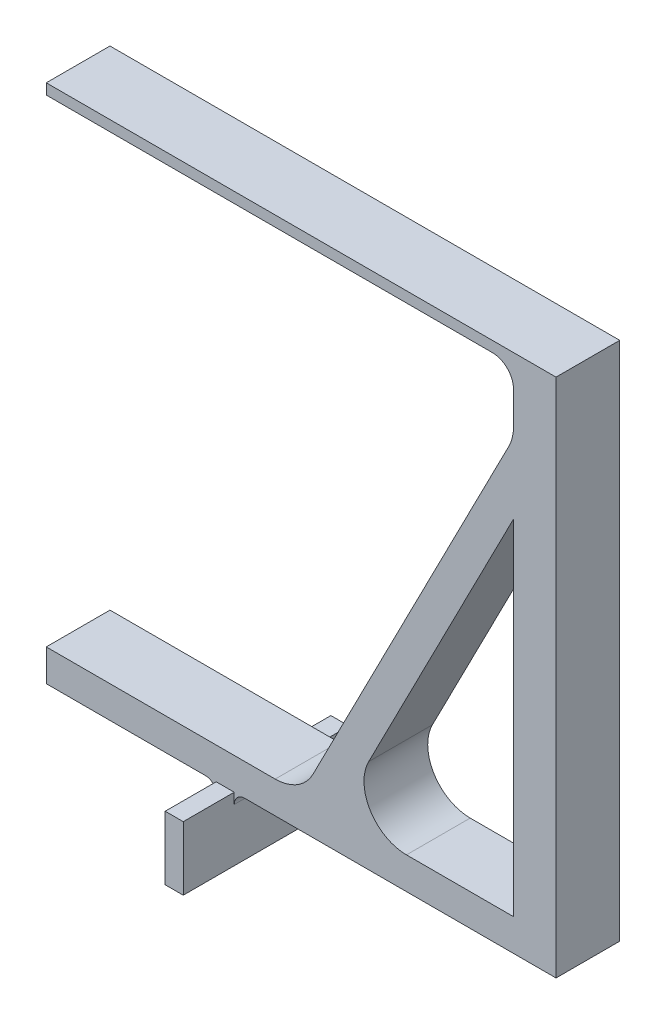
ISO-10303-21;
HEADER;
FILE_DESCRIPTION(('STEP AP214'),'2;1');
FILE_NAME('part.step','',(''),(''),'','','');
FILE_SCHEMA(('AUTOMOTIVE_DESIGN { 1 0 10303 214 1 1 1 1 }'));
ENDSEC;
DATA;
#1=APPLICATION_CONTEXT('core data for automotive mechanical design processes');
#2=APPLICATION_PROTOCOL_DEFINITION('international standard','automotive_design',2000,#1);
#3=PRODUCT_CONTEXT('',#1,'mechanical');
#4=PRODUCT('Part','Part','',(#3));
#5=PRODUCT_RELATED_PRODUCT_CATEGORY('part','',(#4));
#6=PRODUCT_DEFINITION_FORMATION('','',#4);
#7=PRODUCT_DEFINITION_CONTEXT('part definition',#1,'design');
#8=PRODUCT_DEFINITION('design','',#6,#7);
#9=PRODUCT_DEFINITION_SHAPE('','',#8);
#10=(LENGTH_UNIT() NAMED_UNIT(*) SI_UNIT(.MILLI.,.METRE.));
#11=(NAMED_UNIT(*) PLANE_ANGLE_UNIT() SI_UNIT($,.RADIAN.));
#12=(NAMED_UNIT(*) SI_UNIT($,.STERADIAN.) SOLID_ANGLE_UNIT());
#13=UNCERTAINTY_MEASURE_WITH_UNIT(LENGTH_MEASURE(1.E-05),#10,'distance_accuracy_value','');
#14=(GEOMETRIC_REPRESENTATION_CONTEXT(3) GLOBAL_UNCERTAINTY_ASSIGNED_CONTEXT((#13)) GLOBAL_UNIT_ASSIGNED_CONTEXT((#10,
#11,#12)) REPRESENTATION_CONTEXT('',''));
#15=CARTESIAN_POINT('',(0.,0.,0.));
#16=DIRECTION('',(0.,0.,1.));
#17=DIRECTION('',(1.,0.,0.));
#18=AXIS2_PLACEMENT_3D('',#15,#16,#17);
#19=CARTESIAN_POINT('',(0.,0.,3.));
#20=DIRECTION('',(0.,0.,1.));
#21=DIRECTION('',(1.,0.,0.));
#22=AXIS2_PLACEMENT_3D('',#19,#20,#21);
#23=PLANE('',#22);
#24=DIRECTION('',(-1.,0.,0.));
#25=VECTOR('',#24,1.);
#26=CARTESIAN_POINT('',(0.,3.,3.));
#27=LINE('',#26,#25);
#28=CARTESIAN_POINT('',(0.85,3.,3.));
#29=VERTEX_POINT('',#28);
#30=CARTESIAN_POINT('',(0.,3.,3.));
#31=VERTEX_POINT('',#30);
#32=EDGE_CURVE('E276',#29,#31,#27,.T.);
#33=ORIENTED_EDGE('',*,*,#32,.F.);
#34=DIRECTION('',(0.,1.,0.));
#35=VECTOR('',#34,1.);
#36=CARTESIAN_POINT('',(0.85,3.,3.));
#37=LINE('',#36,#35);
#38=CARTESIAN_POINT('',(0.85,2.5,3.));
#39=VERTEX_POINT('',#38);
#40=EDGE_CURVE('E401',#39,#29,#37,.T.);
#41=ORIENTED_EDGE('',*,*,#40,.F.);
#42=CARTESIAN_POINT('',(1.35,2.5,3.));
#43=DIRECTION('',(0.,0.,1.));
#44=DIRECTION('',(1.,0.,0.));
#45=AXIS2_PLACEMENT_3D('',#42,#43,#44);
#46=CIRCLE('',#45,0.5);
#47=CARTESIAN_POINT('',(1.35,3.,3.));
#48=VERTEX_POINT('',#47);
#49=EDGE_CURVE('E11',#39,#48,#46,.F.);
#50=ORIENTED_EDGE('',*,*,#49,.T.);
#51=DIRECTION('',(1.,0.,0.));
#52=VECTOR('',#51,1.);
#53=CARTESIAN_POINT('',(0.85,3.,3.));
#54=LINE('',#53,#52);
#55=CARTESIAN_POINT('',(16.,3.,3.));
#56=VERTEX_POINT('',#55);
#57=EDGE_CURVE('E222',#48,#56,#54,.T.);
#58=ORIENTED_EDGE('',*,*,#57,.T.);
#59=DIRECTION('',(0.,1.,0.));
#60=VECTOR('',#59,1.);
#61=CARTESIAN_POINT('',(16.,3.,3.));
#62=LINE('',#61,#60);
#63=CARTESIAN_POINT('',(16.,27.5,3.));
#64=VERTEX_POINT('',#63);
#65=EDGE_CURVE('E302',#56,#64,#62,.T.);
#66=ORIENTED_EDGE('',*,*,#65,.T.);
#67=DIRECTION('',(-1.,0.,0.));
#68=VECTOR('',#67,1.);
#69=CARTESIAN_POINT('',(14.,27.5,3.));
#70=LINE('',#69,#68);
#71=CARTESIAN_POINT('',(-8.,27.5,3.));
#72=VERTEX_POINT('',#71);
#73=EDGE_CURVE('E304',#64,#72,#70,.T.);
#74=ORIENTED_EDGE('',*,*,#73,.T.);
#75=DIRECTION('',(0.,-1.,0.));
#76=VECTOR('',#75,1.);
#77=CARTESIAN_POINT('',(-8.,27.5,3.));
#78=LINE('',#77,#76);
#79=CARTESIAN_POINT('',(-8.,27.,3.));
#80=VERTEX_POINT('',#79);
#81=EDGE_CURVE('E306',#72,#80,#78,.T.);
#82=ORIENTED_EDGE('',*,*,#81,.T.);
#83=DIRECTION('',(1.,0.,0.));
#84=VECTOR('',#83,1.);
#85=CARTESIAN_POINT('',(14.,27.,3.));
#86=LINE('',#85,#84);
#87=CARTESIAN_POINT('',(13.,27.,3.));
#88=VERTEX_POINT('',#87);
#89=EDGE_CURVE('E308',#80,#88,#86,.T.);
#90=ORIENTED_EDGE('',*,*,#89,.T.);
#91=CARTESIAN_POINT('',(13.,26.,3.));
#92=DIRECTION('',(0.,0.,1.));
#93=DIRECTION('',(1.,0.,0.));
#94=AXIS2_PLACEMENT_3D('',#91,#92,#93);
#95=CIRCLE('',#94,1.);
#96=CARTESIAN_POINT('',(14.,26.,3.));
#97=VERTEX_POINT('',#96);
#98=EDGE_CURVE('E388',#88,#97,#95,.F.);
#99=ORIENTED_EDGE('',*,*,#98,.T.);
#100=DIRECTION('',(0.,-1.,0.));
#101=VECTOR('',#100,1.);
#102=CARTESIAN_POINT('',(14.,24.,3.));
#103=LINE('',#102,#101);
#104=CARTESIAN_POINT('',(14.,24.4829214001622,3.));
#105=VERTEX_POINT('',#104);
#106=EDGE_CURVE('E311',#97,#105,#103,.T.);
#107=ORIENTED_EDGE('',*,*,#106,.T.);
#108=CARTESIAN_POINT('',(12.,24.4829214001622,3.));
#109=DIRECTION('',(0.,0.,1.));
#110=DIRECTION('',(1.,0.,0.));
#111=AXIS2_PLACEMENT_3D('',#108,#109,#110);
#112=CIRCLE('',#111,2.);
#113=CARTESIAN_POINT('',(13.7796349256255,23.5702881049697,3.));
#114=VERTEX_POINT('',#113);
#115=EDGE_CURVE('E375',#105,#114,#112,.F.);
#116=ORIENTED_EDGE('',*,*,#115,.T.);
#117=DIRECTION('',(-0.456316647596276,-0.889817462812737,0.));
#118=VECTOR('',#117,1.);
#119=CARTESIAN_POINT('',(14.,24.,3.));
#120=LINE('',#119,#118);
#121=CARTESIAN_POINT('',(4.5576239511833,5.58736670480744,3.));
#122=VERTEX_POINT('',#121);
#123=EDGE_CURVE('E313',#114,#122,#120,.T.);
#124=ORIENTED_EDGE('',*,*,#123,.T.);
#125=CARTESIAN_POINT('',(2.77798902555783,6.5,3.));
#126=DIRECTION('',(0.,0.,1.));
#127=DIRECTION('',(1.,0.,0.));
#128=AXIS2_PLACEMENT_3D('',#125,#126,#127);
#129=CIRCLE('',#128,2.);
#130=CARTESIAN_POINT('',(2.77798902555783,4.5,3.));
#131=VERTEX_POINT('',#130);
#132=EDGE_CURVE('E379',#122,#131,#129,.F.);
#133=ORIENTED_EDGE('',*,*,#132,.T.);
#134=DIRECTION('',(-1.,0.,0.));
#135=VECTOR('',#134,1.);
#136=CARTESIAN_POINT('',(-4.,4.5,3.));
#137=LINE('',#136,#135);
#138=CARTESIAN_POINT('',(-8.,4.5,3.));
#139=VERTEX_POINT('',#138);
#140=EDGE_CURVE('E316',#131,#139,#137,.T.);
#141=ORIENTED_EDGE('',*,*,#140,.T.);
#142=DIRECTION('',(0.,1.,0.));
#143=VECTOR('',#142,1.);
#144=CARTESIAN_POINT('',(-8.,3.,3.));
#145=LINE('',#144,#143);
#146=CARTESIAN_POINT('',(-8.,3.,3.));
#147=VERTEX_POINT('',#146);
#148=EDGE_CURVE('E233',#147,#139,#145,.T.);
#149=ORIENTED_EDGE('',*,*,#148,.F.);
#150=DIRECTION('',(1.,0.,0.));
#151=VECTOR('',#150,1.);
#152=CARTESIAN_POINT('',(0.,3.,3.));
#153=LINE('',#152,#151);
#154=CARTESIAN_POINT('',(-0.5,3.,3.));
#155=VERTEX_POINT('',#154);
#156=EDGE_CURVE('E229',#147,#155,#153,.T.);
#157=ORIENTED_EDGE('',*,*,#156,.T.);
#158=CARTESIAN_POINT('',(-0.5,2.5,3.));
#159=DIRECTION('',(0.,0.,1.));
#160=DIRECTION('',(1.,0.,0.));
#161=AXIS2_PLACEMENT_3D('',#158,#159,#160);
#162=CIRCLE('',#161,0.5);
#163=CARTESIAN_POINT('',(0.,2.5,3.));
#164=VERTEX_POINT('',#163);
#165=EDGE_CURVE('E408',#155,#164,#162,.F.);
#166=ORIENTED_EDGE('',*,*,#165,.T.);
#167=DIRECTION('',(0.,-1.,0.));
#168=VECTOR('',#167,1.);
#169=CARTESIAN_POINT('',(0.,3.,3.));
#170=LINE('',#169,#168);
#171=EDGE_CURVE('E60',#31,#164,#170,.T.);
#172=ORIENTED_EDGE('',*,*,#171,.F.);
#173=EDGE_LOOP('',(#33,#41,#50,#58,#66,#74,#82,#90,#99,#107,#116,#124,#133,#141,#149,#157,#166,#172));
#174=FACE_BOUND('',#173,.T.);
#175=DIRECTION('',(0.,1.,0.));
#176=VECTOR('',#175,1.);
#177=CARTESIAN_POINT('',(14.,4.5,3.));
#178=LINE('',#177,#176);
#179=CARTESIAN_POINT('',(14.,4.5,3.));
#180=VERTEX_POINT('',#179);
#181=CARTESIAN_POINT('',(14.,20.7128089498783,3.));
#182=VERTEX_POINT('',#181);
#183=EDGE_CURVE('E282',#180,#182,#178,.T.);
#184=ORIENTED_EDGE('',*,*,#183,.F.);
#185=DIRECTION('',(1.,0.,0.));
#186=VECTOR('',#185,1.);
#187=CARTESIAN_POINT('',(5.6857390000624,4.5,3.));
#188=LINE('',#187,#186);
#189=CARTESIAN_POINT('',(8.95903202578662,4.5,3.));
#190=VERTEX_POINT('',#189);
#191=EDGE_CURVE('E280',#190,#180,#188,.T.);
#192=ORIENTED_EDGE('',*,*,#191,.F.);
#193=CARTESIAN_POINT('',(8.95903202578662,6.5,3.));
#194=DIRECTION('',(0.,0.,1.));
#195=DIRECTION('',(1.,0.,0.));
#196=AXIS2_PLACEMENT_3D('',#193,#194,#195);
#197=CIRCLE('',#196,2.);
#198=CARTESIAN_POINT('',(7.17939710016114,7.41263329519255,3.));
#199=VERTEX_POINT('',#198);
#200=EDGE_CURVE('E370',#190,#199,#197,.F.);
#201=ORIENTED_EDGE('',*,*,#200,.T.);
#202=DIRECTION('',(-0.456316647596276,-0.889817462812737,0.));
#203=VECTOR('',#202,1.);
#204=CARTESIAN_POINT('',(5.6857390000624,4.5,3.));
#205=LINE('',#204,#203);
#206=EDGE_CURVE('E286',#182,#199,#205,.T.);
#207=ORIENTED_EDGE('',*,*,#206,.F.);
#208=EDGE_LOOP('',(#184,#192,#201,#207));
#209=FACE_BOUND('',#208,.T.);
#210=ADVANCED_FACE('F37',(#174,#209),#23,.T.);
#211=CARTESIAN_POINT('',(0.,0.,0.));
#212=DIRECTION('',(0.,0.,1.));
#213=DIRECTION('',(1.,0.,0.));
#214=AXIS2_PLACEMENT_3D('',#211,#212,#213);
#215=PLANE('',#214);
#216=DIRECTION('',(1.,0.,0.));
#217=VECTOR('',#216,1.);
#218=CARTESIAN_POINT('',(0.85,3.,0.));
#219=LINE('',#218,#217);
#220=CARTESIAN_POINT('',(1.35,3.,0.));
#221=VERTEX_POINT('',#220);
#222=CARTESIAN_POINT('',(16.,3.,0.));
#223=VERTEX_POINT('',#222);
#224=EDGE_CURVE('E300',#221,#223,#219,.T.);
#225=ORIENTED_EDGE('',*,*,#224,.F.);
#226=CARTESIAN_POINT('',(1.35,2.5,0.));
#227=DIRECTION('',(0.,0.,1.));
#228=DIRECTION('',(1.,0.,0.));
#229=AXIS2_PLACEMENT_3D('',#226,#227,#228);
#230=CIRCLE('',#229,0.5);
#231=CARTESIAN_POINT('',(0.85,2.5,0.));
#232=VERTEX_POINT('',#231);
#233=EDGE_CURVE('E45',#221,#232,#230,.T.);
#234=ORIENTED_EDGE('',*,*,#233,.T.);
#235=DIRECTION('',(0.,-1.,0.));
#236=VECTOR('',#235,1.);
#237=CARTESIAN_POINT('',(0.85,0.,0.));
#238=LINE('',#237,#236);
#239=CARTESIAN_POINT('',(0.85,3.,0.));
#240=VERTEX_POINT('',#239);
#241=EDGE_CURVE('E52',#240,#232,#238,.T.);
#242=ORIENTED_EDGE('',*,*,#241,.F.);
#243=DIRECTION('',(-1.,0.,0.));
#244=VECTOR('',#243,1.);
#245=CARTESIAN_POINT('',(0.,3.,0.));
#246=LINE('',#245,#244);
#247=CARTESIAN_POINT('',(0.,3.,0.));
#248=VERTEX_POINT('',#247);
#249=EDGE_CURVE('E271',#240,#248,#246,.T.);
#250=ORIENTED_EDGE('',*,*,#249,.T.);
#251=DIRECTION('',(0.,1.,0.));
#252=VECTOR('',#251,1.);
#253=CARTESIAN_POINT('',(0.,0.,0.));
#254=LINE('',#253,#252);
#255=CARTESIAN_POINT('',(0.,2.5,0.));
#256=VERTEX_POINT('',#255);
#257=EDGE_CURVE('E394',#256,#248,#254,.T.);
#258=ORIENTED_EDGE('',*,*,#257,.F.);
#259=CARTESIAN_POINT('',(-0.5,2.5,0.));
#260=DIRECTION('',(0.,0.,1.));
#261=DIRECTION('',(1.,0.,0.));
#262=AXIS2_PLACEMENT_3D('',#259,#260,#261);
#263=CIRCLE('',#262,0.5);
#264=CARTESIAN_POINT('',(-0.5,3.,0.));
#265=VERTEX_POINT('',#264);
#266=EDGE_CURVE('E219',#256,#265,#263,.T.);
#267=ORIENTED_EDGE('',*,*,#266,.T.);
#268=DIRECTION('',(1.,0.,0.));
#269=VECTOR('',#268,1.);
#270=CARTESIAN_POINT('',(0.,3.,0.));
#271=LINE('',#270,#269);
#272=CARTESIAN_POINT('',(-8.,3.,0.));
#273=VERTEX_POINT('',#272);
#274=EDGE_CURVE('E210',#273,#265,#271,.T.);
#275=ORIENTED_EDGE('',*,*,#274,.F.);
#276=DIRECTION('',(0.,-1.,0.));
#277=VECTOR('',#276,1.);
#278=CARTESIAN_POINT('',(-8.,3.,0.));
#279=LINE('',#278,#277);
#280=CARTESIAN_POINT('',(-8.,4.5,0.));
#281=VERTEX_POINT('',#280);
#282=EDGE_CURVE('E217',#281,#273,#279,.T.);
#283=ORIENTED_EDGE('',*,*,#282,.F.);
#284=DIRECTION('',(-1.,0.,0.));
#285=VECTOR('',#284,1.);
#286=CARTESIAN_POINT('',(-4.,4.5,0.));
#287=LINE('',#286,#285);
#288=CARTESIAN_POINT('',(2.77798902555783,4.5,0.));
#289=VERTEX_POINT('',#288);
#290=EDGE_CURVE('E223',#289,#281,#287,.T.);
#291=ORIENTED_EDGE('',*,*,#290,.F.);
#292=CARTESIAN_POINT('',(2.77798902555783,6.5,0.));
#293=DIRECTION('',(0.,0.,1.));
#294=DIRECTION('',(1.,0.,0.));
#295=AXIS2_PLACEMENT_3D('',#292,#293,#294);
#296=CIRCLE('',#295,2.);
#297=CARTESIAN_POINT('',(4.5576239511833,5.58736670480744,0.));
#298=VERTEX_POINT('',#297);
#299=EDGE_CURVE('E377',#289,#298,#296,.T.);
#300=ORIENTED_EDGE('',*,*,#299,.T.);
#301=DIRECTION('',(-0.456316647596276,-0.889817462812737,0.));
#302=VECTOR('',#301,1.);
#303=CARTESIAN_POINT('',(14.,24.,0.));
#304=LINE('',#303,#302);
#305=CARTESIAN_POINT('',(13.7796349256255,23.5702881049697,0.));
#306=VERTEX_POINT('',#305);
#307=EDGE_CURVE('E333',#306,#298,#304,.T.);
#308=ORIENTED_EDGE('',*,*,#307,.F.);
#309=CARTESIAN_POINT('',(12.,24.4829214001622,0.));
#310=DIRECTION('',(0.,0.,1.));
#311=DIRECTION('',(1.,0.,0.));
#312=AXIS2_PLACEMENT_3D('',#309,#310,#311);
#313=CIRCLE('',#312,2.);
#314=CARTESIAN_POINT('',(14.,24.4829214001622,0.));
#315=VERTEX_POINT('',#314);
#316=EDGE_CURVE('E372',#306,#315,#313,.T.);
#317=ORIENTED_EDGE('',*,*,#316,.T.);
#318=DIRECTION('',(0.,-1.,0.));
#319=VECTOR('',#318,1.);
#320=CARTESIAN_POINT('',(14.,24.,0.));
#321=LINE('',#320,#319);
#322=CARTESIAN_POINT('',(14.,26.,0.));
#323=VERTEX_POINT('',#322);
#324=EDGE_CURVE('E331',#323,#315,#321,.T.);
#325=ORIENTED_EDGE('',*,*,#324,.F.);
#326=CARTESIAN_POINT('',(13.,26.,0.));
#327=DIRECTION('',(0.,0.,1.));
#328=DIRECTION('',(1.,0.,0.));
#329=AXIS2_PLACEMENT_3D('',#326,#327,#328);
#330=CIRCLE('',#329,1.);
#331=CARTESIAN_POINT('',(13.,27.,0.));
#332=VERTEX_POINT('',#331);
#333=EDGE_CURVE('E386',#323,#332,#330,.T.);
#334=ORIENTED_EDGE('',*,*,#333,.T.);
#335=DIRECTION('',(1.,0.,0.));
#336=VECTOR('',#335,1.);
#337=CARTESIAN_POINT('',(14.,27.,0.));
#338=LINE('',#337,#336);
#339=CARTESIAN_POINT('',(-8.,27.,0.));
#340=VERTEX_POINT('',#339);
#341=EDGE_CURVE('E328',#340,#332,#338,.T.);
#342=ORIENTED_EDGE('',*,*,#341,.F.);
#343=DIRECTION('',(0.,-1.,0.));
#344=VECTOR('',#343,1.);
#345=CARTESIAN_POINT('',(-8.,27.5,0.));
#346=LINE('',#345,#344);
#347=CARTESIAN_POINT('',(-8.,27.5,0.));
#348=VERTEX_POINT('',#347);
#349=EDGE_CURVE('E326',#348,#340,#346,.T.);
#350=ORIENTED_EDGE('',*,*,#349,.F.);
#351=DIRECTION('',(-1.,0.,0.));
#352=VECTOR('',#351,1.);
#353=CARTESIAN_POINT('',(14.,27.5,0.));
#354=LINE('',#353,#352);
#355=CARTESIAN_POINT('',(16.,27.5,0.));
#356=VERTEX_POINT('',#355);
#357=EDGE_CURVE('E324',#356,#348,#354,.T.);
#358=ORIENTED_EDGE('',*,*,#357,.F.);
#359=DIRECTION('',(0.,1.,0.));
#360=VECTOR('',#359,1.);
#361=CARTESIAN_POINT('',(16.,3.,0.));
#362=LINE('',#361,#360);
#363=EDGE_CURVE('E321',#223,#356,#362,.T.);
#364=ORIENTED_EDGE('',*,*,#363,.F.);
#365=EDGE_LOOP('',(#225,#234,#242,#250,#258,#267,#275,#283,#291,#300,#308,#317,#325,#334,#342,
#350,#358,#364));
#366=FACE_BOUND('',#365,.T.);
#367=DIRECTION('',(-0.456316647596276,-0.889817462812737,0.));
#368=VECTOR('',#367,1.);
#369=CARTESIAN_POINT('',(5.6857390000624,4.5,0.));
#370=LINE('',#369,#368);
#371=CARTESIAN_POINT('',(14.,20.7128089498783,0.));
#372=VERTEX_POINT('',#371);
#373=CARTESIAN_POINT('',(7.17939710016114,7.41263329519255,0.));
#374=VERTEX_POINT('',#373);
#375=EDGE_CURVE('E283',#372,#374,#370,.T.);
#376=ORIENTED_EDGE('',*,*,#375,.T.);
#377=CARTESIAN_POINT('',(8.95903202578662,6.5,0.));
#378=DIRECTION('',(0.,0.,1.));
#379=DIRECTION('',(1.,0.,0.));
#380=AXIS2_PLACEMENT_3D('',#377,#378,#379);
#381=CIRCLE('',#380,2.);
#382=CARTESIAN_POINT('',(8.95903202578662,4.5,0.));
#383=VERTEX_POINT('',#382);
#384=EDGE_CURVE('E368',#374,#383,#381,.T.);
#385=ORIENTED_EDGE('',*,*,#384,.T.);
#386=DIRECTION('',(1.,0.,0.));
#387=VECTOR('',#386,1.);
#388=CARTESIAN_POINT('',(5.6857390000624,4.5,0.));
#389=LINE('',#388,#387);
#390=CARTESIAN_POINT('',(14.,4.5,0.));
#391=VERTEX_POINT('',#390);
#392=EDGE_CURVE('E279',#383,#391,#389,.T.);
#393=ORIENTED_EDGE('',*,*,#392,.T.);
#394=DIRECTION('',(0.,1.,0.));
#395=VECTOR('',#394,1.);
#396=CARTESIAN_POINT('',(14.,4.5,0.));
#397=LINE('',#396,#395);
#398=EDGE_CURVE('E291',#391,#372,#397,.T.);
#399=ORIENTED_EDGE('',*,*,#398,.T.);
#400=EDGE_LOOP('',(#376,#385,#393,#399));
#401=FACE_BOUND('',#400,.T.);
#402=ADVANCED_FACE('F213',(#366,#401),#215,.F.);
#403=CARTESIAN_POINT('',(0.85,3.,3.));
#404=DIRECTION('',(-1.,0.,0.));
#405=DIRECTION('',(0.,-1.,0.));
#406=AXIS2_PLACEMENT_3D('',#403,#404,#405);
#407=PLANE('',#406);
#408=DIRECTION('',(0.,0.,1.));
#409=VECTOR('',#408,1.);
#410=CARTESIAN_POINT('',(0.85,3.,-2.4));
#411=LINE('',#410,#409);
#412=CARTESIAN_POINT('',(0.85,3.,-2.4));
#413=VERTEX_POINT('',#412);
#414=EDGE_CURVE('E273',#413,#240,#411,.T.);
#415=ORIENTED_EDGE('',*,*,#414,.T.);
#416=ORIENTED_EDGE('',*,*,#241,.T.);
#417=DIRECTION('',(0.,0.,-1.));
#418=VECTOR('',#417,1.);
#419=CARTESIAN_POINT('',(0.85,2.5,3.));
#420=LINE('',#419,#418);
#421=EDGE_CURVE('E403',#232,#39,#420,.F.);
#422=ORIENTED_EDGE('',*,*,#421,.T.);
#423=ORIENTED_EDGE('',*,*,#40,.T.);
#424=CARTESIAN_POINT('',(0.85,3.,5.4));
#425=VERTEX_POINT('',#424);
#426=EDGE_CURVE('E267',#29,#425,#411,.T.);
#427=ORIENTED_EDGE('',*,*,#426,.T.);
#428=DIRECTION('',(0.,1.,0.));
#429=VECTOR('',#428,1.);
#430=CARTESIAN_POINT('',(0.85,0.,5.4));
#431=LINE('',#430,#429);
#432=CARTESIAN_POINT('',(0.85,0.,5.4));
#433=VERTEX_POINT('',#432);
#434=EDGE_CURVE('E249',#433,#425,#431,.T.);
#435=ORIENTED_EDGE('',*,*,#434,.F.);
#436=DIRECTION('',(0.,0.,-1.));
#437=VECTOR('',#436,1.);
#438=CARTESIAN_POINT('',(0.85,0.,3.));
#439=LINE('',#438,#437);
#440=CARTESIAN_POINT('',(0.85,0.,-2.4));
#441=VERTEX_POINT('',#440);
#442=EDGE_CURVE('E319',#433,#441,#439,.T.);
#443=ORIENTED_EDGE('',*,*,#442,.T.);
#444=DIRECTION('',(0.,1.,0.));
#445=VECTOR('',#444,1.);
#446=CARTESIAN_POINT('',(0.85,0.,-2.4));
#447=LINE('',#446,#445);
#448=EDGE_CURVE('E261',#441,#413,#447,.T.);
#449=ORIENTED_EDGE('',*,*,#448,.T.);
#450=EDGE_LOOP('',(#415,#416,#422,#423,#427,#435,#443,#449));
#451=FACE_BOUND('',#450,.T.);
#452=ADVANCED_FACE('F414',(#451),#407,.F.);
#453=CARTESIAN_POINT('',(0.85,3.,3.));
#454=DIRECTION('',(0.,1.,0.));
#455=DIRECTION('',(0.,0.,1.));
#456=AXIS2_PLACEMENT_3D('',#453,#454,#455);
#457=PLANE('',#456);
#458=ORIENTED_EDGE('',*,*,#57,.F.);
#459=DIRECTION('',(0.,0.,-1.));
#460=VECTOR('',#459,1.);
#461=CARTESIAN_POINT('',(1.35,3.,0.));
#462=LINE('',#461,#460);
#463=EDGE_CURVE('E398',#48,#221,#462,.T.);
#464=ORIENTED_EDGE('',*,*,#463,.T.);
#465=ORIENTED_EDGE('',*,*,#224,.T.);
#466=DIRECTION('',(0.,0.,-1.));
#467=VECTOR('',#466,1.);
#468=CARTESIAN_POINT('',(16.,3.,3.));
#469=LINE('',#468,#467);
#470=EDGE_CURVE('E349',#56,#223,#469,.T.);
#471=ORIENTED_EDGE('',*,*,#470,.F.);
#472=EDGE_LOOP('',(#458,#464,#465,#471));
#473=FACE_BOUND('',#472,.T.);
#474=ADVANCED_FACE('F421',(#473),#457,.F.);
#475=CARTESIAN_POINT('',(16.,3.,3.));
#476=DIRECTION('',(-1.,0.,0.));
#477=DIRECTION('',(0.,-1.,0.));
#478=AXIS2_PLACEMENT_3D('',#475,#476,#477);
#479=PLANE('',#478);
#480=ORIENTED_EDGE('',*,*,#363,.T.);
#481=DIRECTION('',(0.,0.,-1.));
#482=VECTOR('',#481,1.);
#483=CARTESIAN_POINT('',(16.,27.5,3.));
#484=LINE('',#483,#482);
#485=EDGE_CURVE('E346',#64,#356,#484,.T.);
#486=ORIENTED_EDGE('',*,*,#485,.F.);
#487=ORIENTED_EDGE('',*,*,#65,.F.);
#488=ORIENTED_EDGE('',*,*,#470,.T.);
#489=EDGE_LOOP('',(#480,#486,#487,#488));
#490=FACE_BOUND('',#489,.T.);
#491=ADVANCED_FACE('F425',(#490),#479,.F.);
#492=CARTESIAN_POINT('',(14.,27.5,3.));
#493=DIRECTION('',(0.,-1.,0.));
#494=DIRECTION('',(1.,0.,0.));
#495=AXIS2_PLACEMENT_3D('',#492,#493,#494);
#496=PLANE('',#495);
#497=ORIENTED_EDGE('',*,*,#357,.T.);
#498=DIRECTION('',(0.,0.,-1.));
#499=VECTOR('',#498,1.);
#500=CARTESIAN_POINT('',(-8.,27.5,3.));
#501=LINE('',#500,#499);
#502=EDGE_CURVE('E343',#72,#348,#501,.T.);
#503=ORIENTED_EDGE('',*,*,#502,.F.);
#504=ORIENTED_EDGE('',*,*,#73,.F.);
#505=ORIENTED_EDGE('',*,*,#485,.T.);
#506=EDGE_LOOP('',(#497,#503,#504,#505));
#507=FACE_BOUND('',#506,.T.);
#508=ADVANCED_FACE('F431',(#507),#496,.F.);
#509=CARTESIAN_POINT('',(-8.,27.5,3.));
#510=DIRECTION('',(1.,0.,0.));
#511=DIRECTION('',(0.,0.,-1.));
#512=AXIS2_PLACEMENT_3D('',#509,#510,#511);
#513=PLANE('',#512);
#514=ORIENTED_EDGE('',*,*,#349,.T.);
#515=DIRECTION('',(0.,0.,-1.));
#516=VECTOR('',#515,1.);
#517=CARTESIAN_POINT('',(-8.,27.,3.));
#518=LINE('',#517,#516);
#519=EDGE_CURVE('E340',#80,#340,#518,.T.);
#520=ORIENTED_EDGE('',*,*,#519,.F.);
#521=ORIENTED_EDGE('',*,*,#81,.F.);
#522=ORIENTED_EDGE('',*,*,#502,.T.);
#523=EDGE_LOOP('',(#514,#520,#521,#522));
#524=FACE_BOUND('',#523,.T.);
#525=ADVANCED_FACE('F434',(#524),#513,.F.);
#526=CARTESIAN_POINT('',(14.,27.,3.));
#527=DIRECTION('',(0.,1.,0.));
#528=DIRECTION('',(-1.,0.,0.));
#529=AXIS2_PLACEMENT_3D('',#526,#527,#528);
#530=PLANE('',#529);
#531=ORIENTED_EDGE('',*,*,#341,.T.);
#532=DIRECTION('',(0.,0.,-1.));
#533=VECTOR('',#532,1.);
#534=CARTESIAN_POINT('',(13.,27.,3.));
#535=LINE('',#534,#533);
#536=EDGE_CURVE('E384',#332,#88,#535,.F.);
#537=ORIENTED_EDGE('',*,*,#536,.T.);
#538=ORIENTED_EDGE('',*,*,#89,.F.);
#539=ORIENTED_EDGE('',*,*,#519,.T.);
#540=EDGE_LOOP('',(#531,#537,#538,#539));
#541=FACE_BOUND('',#540,.T.);
#542=ADVANCED_FACE('F438',(#541),#530,.F.);
#543=CARTESIAN_POINT('',(14.,24.,3.));
#544=DIRECTION('',(1.,0.,0.));
#545=DIRECTION('',(0.,1.,0.));
#546=AXIS2_PLACEMENT_3D('',#543,#544,#545);
#547=PLANE('',#546);
#548=ORIENTED_EDGE('',*,*,#106,.F.);
#549=DIRECTION('',(0.,0.,-1.));
#550=VECTOR('',#549,1.);
#551=CARTESIAN_POINT('',(14.,26.,0.));
#552=LINE('',#551,#550);
#553=EDGE_CURVE('E381',#97,#323,#552,.T.);
#554=ORIENTED_EDGE('',*,*,#553,.T.);
#555=ORIENTED_EDGE('',*,*,#324,.T.);
#556=DIRECTION('',(0.,0.,-1.));
#557=VECTOR('',#556,1.);
#558=CARTESIAN_POINT('',(14.,24.4829214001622,3.));
#559=LINE('',#558,#557);
#560=EDGE_CURVE('E362',#315,#105,#559,.F.);
#561=ORIENTED_EDGE('',*,*,#560,.T.);
#562=EDGE_LOOP('',(#548,#554,#555,#561));
#563=FACE_BOUND('',#562,.T.);
#564=ADVANCED_FACE('F447',(#563),#547,.F.);
#565=CARTESIAN_POINT('',(14.,24.,3.));
#566=DIRECTION('',(0.889817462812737,-0.456316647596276,0.));
#567=DIRECTION('',(0.456316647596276,0.889817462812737,0.));
#568=AXIS2_PLACEMENT_3D('',#565,#566,#567);
#569=PLANE('',#568);
#570=ORIENTED_EDGE('',*,*,#123,.F.);
#571=DIRECTION('',(0.,0.,-1.));
#572=VECTOR('',#571,1.);
#573=CARTESIAN_POINT('',(13.7796349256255,23.5702881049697,0.));
#574=LINE('',#573,#572);
#575=EDGE_CURVE('E359',#114,#306,#574,.T.);
#576=ORIENTED_EDGE('',*,*,#575,.T.);
#577=ORIENTED_EDGE('',*,*,#307,.T.);
#578=DIRECTION('',(0.,0.,-1.));
#579=VECTOR('',#578,1.);
#580=CARTESIAN_POINT('',(4.5576239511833,5.58736670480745,3.));
#581=LINE('',#580,#579);
#582=EDGE_CURVE('E357',#298,#122,#581,.F.);
#583=ORIENTED_EDGE('',*,*,#582,.T.);
#584=EDGE_LOOP('',(#570,#576,#577,#583));
#585=FACE_BOUND('',#584,.T.);
#586=ADVANCED_FACE('F457',(#585),#569,.F.);
#587=CARTESIAN_POINT('',(-4.,4.5,3.));
#588=DIRECTION('',(0.,-1.,0.));
#589=DIRECTION('',(0.,0.,-1.));
#590=AXIS2_PLACEMENT_3D('',#587,#588,#589);
#591=PLANE('',#590);
#592=ORIENTED_EDGE('',*,*,#140,.F.);
#593=DIRECTION('',(0.,0.,-1.));
#594=VECTOR('',#593,1.);
#595=CARTESIAN_POINT('',(2.77798902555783,4.5,0.));
#596=LINE('',#595,#594);
#597=EDGE_CURVE('E365',#131,#289,#596,.T.);
#598=ORIENTED_EDGE('',*,*,#597,.T.);
#599=ORIENTED_EDGE('',*,*,#290,.T.);
#600=DIRECTION('',(0.,0.,-1.));
#601=VECTOR('',#600,1.);
#602=CARTESIAN_POINT('',(-8.,4.5,0.));
#603=LINE('',#602,#601);
#604=EDGE_CURVE('E238',#139,#281,#603,.T.);
#605=ORIENTED_EDGE('',*,*,#604,.F.);
#606=EDGE_LOOP('',(#592,#598,#599,#605));
#607=FACE_BOUND('',#606,.T.);
#608=ADVANCED_FACE('F464',(#607),#591,.F.);
#609=CARTESIAN_POINT('',(0.,3.,3.));
#610=DIRECTION('',(0.,1.,0.));
#611=DIRECTION('',(-1.,0.,0.));
#612=AXIS2_PLACEMENT_3D('',#609,#610,#611);
#613=PLANE('',#612);
#614=ORIENTED_EDGE('',*,*,#274,.T.);
#615=DIRECTION('',(0.,0.,-1.));
#616=VECTOR('',#615,1.);
#617=CARTESIAN_POINT('',(-0.5,3.,3.));
#618=LINE('',#617,#616);
#619=EDGE_CURVE('E396',#265,#155,#618,.F.);
#620=ORIENTED_EDGE('',*,*,#619,.T.);
#621=ORIENTED_EDGE('',*,*,#156,.F.);
#622=DIRECTION('',(0.,0.,1.));
#623=VECTOR('',#622,1.);
#624=CARTESIAN_POINT('',(-8.,3.,0.));
#625=LINE('',#624,#623);
#626=EDGE_CURVE('E226',#273,#147,#625,.T.);
#627=ORIENTED_EDGE('',*,*,#626,.F.);
#628=EDGE_LOOP('',(#614,#620,#621,#627));
#629=FACE_BOUND('',#628,.T.);
#630=ADVANCED_FACE('F227',(#629),#613,.F.);
#631=CARTESIAN_POINT('',(0.,3.,3.));
#632=DIRECTION('',(1.,0.,0.));
#633=DIRECTION('',(0.,0.,-1.));
#634=AXIS2_PLACEMENT_3D('',#631,#632,#633);
#635=PLANE('',#634);
#636=DIRECTION('',(0.,0.,-1.));
#637=VECTOR('',#636,1.);
#638=CARTESIAN_POINT('',(0.,2.5,0.));
#639=LINE('',#638,#637);
#640=EDGE_CURVE('E391',#164,#256,#639,.T.);
#641=ORIENTED_EDGE('',*,*,#640,.T.);
#642=ORIENTED_EDGE('',*,*,#257,.T.);
#643=DIRECTION('',(0.,0.,1.));
#644=VECTOR('',#643,1.);
#645=CARTESIAN_POINT('',(0.,3.,-2.4));
#646=LINE('',#645,#644);
#647=CARTESIAN_POINT('',(0.,3.,-2.4));
#648=VERTEX_POINT('',#647);
#649=EDGE_CURVE('E268',#648,#248,#646,.T.);
#650=ORIENTED_EDGE('',*,*,#649,.F.);
#651=DIRECTION('',(0.,-1.,0.));
#652=VECTOR('',#651,1.);
#653=CARTESIAN_POINT('',(0.,0.,-2.4));
#654=LINE('',#653,#652);
#655=CARTESIAN_POINT('',(0.,0.,-2.4));
#656=VERTEX_POINT('',#655);
#657=EDGE_CURVE('E255',#648,#656,#654,.T.);
#658=ORIENTED_EDGE('',*,*,#657,.T.);
#659=DIRECTION('',(0.,0.,-1.));
#660=VECTOR('',#659,1.);
#661=CARTESIAN_POINT('',(0.,0.,3.));
#662=LINE('',#661,#660);
#663=CARTESIAN_POINT('',(0.,0.,5.4));
#664=VERTEX_POINT('',#663);
#665=EDGE_CURVE('E338',#664,#656,#662,.T.);
#666=ORIENTED_EDGE('',*,*,#665,.F.);
#667=DIRECTION('',(0.,-1.,0.));
#668=VECTOR('',#667,1.);
#669=CARTESIAN_POINT('',(0.,0.,5.4));
#670=LINE('',#669,#668);
#671=CARTESIAN_POINT('',(0.,3.,5.4));
#672=VERTEX_POINT('',#671);
#673=EDGE_CURVE('E243',#672,#664,#670,.T.);
#674=ORIENTED_EDGE('',*,*,#673,.F.);
#675=EDGE_CURVE('E272',#31,#672,#646,.T.);
#676=ORIENTED_EDGE('',*,*,#675,.F.);
#677=ORIENTED_EDGE('',*,*,#171,.T.);
#678=EDGE_LOOP('',(#641,#642,#650,#658,#666,#674,#676,#677));
#679=FACE_BOUND('',#678,.T.);
#680=ADVANCED_FACE('F471',(#679),#635,.F.);
#681=CARTESIAN_POINT('',(0.,0.,3.));
#682=DIRECTION('',(0.,1.,0.));
#683=DIRECTION('',(0.,0.,1.));
#684=AXIS2_PLACEMENT_3D('',#681,#682,#683);
#685=PLANE('',#684);
#686=ORIENTED_EDGE('',*,*,#665,.T.);
#687=DIRECTION('',(1.,0.,0.));
#688=VECTOR('',#687,1.);
#689=CARTESIAN_POINT('',(0.,0.,-2.4));
#690=LINE('',#689,#688);
#691=EDGE_CURVE('E258',#656,#441,#690,.T.);
#692=ORIENTED_EDGE('',*,*,#691,.T.);
#693=ORIENTED_EDGE('',*,*,#442,.F.);
#694=DIRECTION('',(1.,0.,0.));
#695=VECTOR('',#694,1.);
#696=CARTESIAN_POINT('',(0.,0.,5.4));
#697=LINE('',#696,#695);
#698=EDGE_CURVE('E246',#664,#433,#697,.T.);
#699=ORIENTED_EDGE('',*,*,#698,.F.);
#700=EDGE_LOOP('',(#686,#692,#693,#699));
#701=FACE_BOUND('',#700,.T.);
#702=ADVANCED_FACE('F484',(#701),#685,.F.);
#703=CARTESIAN_POINT('',(5.6857390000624,4.5,3.));
#704=DIRECTION('',(0.,1.,0.));
#705=DIRECTION('',(0.,0.,1.));
#706=AXIS2_PLACEMENT_3D('',#703,#704,#705);
#707=PLANE('',#706);
#708=ORIENTED_EDGE('',*,*,#392,.F.);
#709=DIRECTION('',(0.,0.,-1.));
#710=VECTOR('',#709,1.);
#711=CARTESIAN_POINT('',(8.95903202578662,4.5,3.));
#712=LINE('',#711,#710);
#713=EDGE_CURVE('E355',#383,#190,#712,.F.);
#714=ORIENTED_EDGE('',*,*,#713,.T.);
#715=ORIENTED_EDGE('',*,*,#191,.T.);
#716=DIRECTION('',(0.,0.,-1.));
#717=VECTOR('',#716,1.);
#718=CARTESIAN_POINT('',(14.,4.5,3.));
#719=LINE('',#718,#717);
#720=EDGE_CURVE('E297',#180,#391,#719,.T.);
#721=ORIENTED_EDGE('',*,*,#720,.T.);
#722=EDGE_LOOP('',(#708,#714,#715,#721));
#723=FACE_BOUND('',#722,.T.);
#724=ADVANCED_FACE('F481',(#723),#707,.T.);
#725=CARTESIAN_POINT('',(14.,4.5,3.));
#726=DIRECTION('',(-1.,0.,0.));
#727=DIRECTION('',(0.,-1.,0.));
#728=AXIS2_PLACEMENT_3D('',#725,#726,#727);
#729=PLANE('',#728);
#730=ORIENTED_EDGE('',*,*,#398,.F.);
#731=ORIENTED_EDGE('',*,*,#720,.F.);
#732=ORIENTED_EDGE('',*,*,#183,.T.);
#733=DIRECTION('',(0.,0.,-1.));
#734=VECTOR('',#733,1.);
#735=CARTESIAN_POINT('',(14.,20.7128089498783,3.));
#736=LINE('',#735,#734);
#737=EDGE_CURVE('E289',#182,#372,#736,.T.);
#738=ORIENTED_EDGE('',*,*,#737,.T.);
#739=EDGE_LOOP('',(#730,#731,#732,#738));
#740=FACE_BOUND('',#739,.T.);
#741=ADVANCED_FACE('F525',(#740),#729,.T.);
#742=CARTESIAN_POINT('',(5.6857390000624,4.5,3.));
#743=DIRECTION('',(0.889817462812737,-0.456316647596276,0.));
#744=DIRECTION('',(0.456316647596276,0.889817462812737,0.));
#745=AXIS2_PLACEMENT_3D('',#742,#743,#744);
#746=PLANE('',#745);
#747=ORIENTED_EDGE('',*,*,#206,.T.);
#748=DIRECTION('',(0.,0.,-1.));
#749=VECTOR('',#748,1.);
#750=CARTESIAN_POINT('',(7.17939710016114,7.41263329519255,0.));
#751=LINE('',#750,#749);
#752=EDGE_CURVE('E352',#199,#374,#751,.T.);
#753=ORIENTED_EDGE('',*,*,#752,.T.);
#754=ORIENTED_EDGE('',*,*,#375,.F.);
#755=ORIENTED_EDGE('',*,*,#737,.F.);
#756=EDGE_LOOP('',(#747,#753,#754,#755));
#757=FACE_BOUND('',#756,.T.);
#758=ADVANCED_FACE('F522',(#757),#746,.T.);
#759=CARTESIAN_POINT('',(8.95903202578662,6.5,3.));
#760=DIRECTION('',(0.,0.,1.));
#761=DIRECTION('',(1.,0.,0.));
#762=AXIS2_PLACEMENT_3D('',#759,#760,#761);
#763=CYLINDRICAL_SURFACE('',#762,2.);
#764=ORIENTED_EDGE('',*,*,#200,.F.);
#765=ORIENTED_EDGE('',*,*,#713,.F.);
#766=ORIENTED_EDGE('',*,*,#384,.F.);
#767=ORIENTED_EDGE('',*,*,#752,.F.);
#768=EDGE_LOOP('',(#764,#765,#766,#767));
#769=FACE_BOUND('',#768,.T.);
#770=ADVANCED_FACE('F524',(#769),#763,.F.);
#771=CARTESIAN_POINT('',(12.,24.4829214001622,3.));
#772=DIRECTION('',(0.,0.,1.));
#773=DIRECTION('',(1.,0.,0.));
#774=AXIS2_PLACEMENT_3D('',#771,#772,#773);
#775=CYLINDRICAL_SURFACE('',#774,2.);
#776=ORIENTED_EDGE('',*,*,#115,.F.);
#777=ORIENTED_EDGE('',*,*,#560,.F.);
#778=ORIENTED_EDGE('',*,*,#316,.F.);
#779=ORIENTED_EDGE('',*,*,#575,.F.);
#780=EDGE_LOOP('',(#776,#777,#778,#779));
#781=FACE_BOUND('',#780,.T.);
#782=ADVANCED_FACE('F453',(#781),#775,.F.);
#783=CARTESIAN_POINT('',(2.77798902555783,6.5,3.));
#784=DIRECTION('',(0.,0.,1.));
#785=DIRECTION('',(1.,0.,0.));
#786=AXIS2_PLACEMENT_3D('',#783,#784,#785);
#787=CYLINDRICAL_SURFACE('',#786,2.);
#788=ORIENTED_EDGE('',*,*,#132,.F.);
#789=ORIENTED_EDGE('',*,*,#582,.F.);
#790=ORIENTED_EDGE('',*,*,#299,.F.);
#791=ORIENTED_EDGE('',*,*,#597,.F.);
#792=EDGE_LOOP('',(#788,#789,#790,#791));
#793=FACE_BOUND('',#792,.T.);
#794=ADVANCED_FACE('F460',(#793),#787,.F.);
#795=CARTESIAN_POINT('',(13.,26.,3.));
#796=DIRECTION('',(0.,0.,1.));
#797=DIRECTION('',(1.,0.,0.));
#798=AXIS2_PLACEMENT_3D('',#795,#796,#797);
#799=CYLINDRICAL_SURFACE('',#798,1.);
#800=ORIENTED_EDGE('',*,*,#98,.F.);
#801=ORIENTED_EDGE('',*,*,#536,.F.);
#802=ORIENTED_EDGE('',*,*,#333,.F.);
#803=ORIENTED_EDGE('',*,*,#553,.F.);
#804=EDGE_LOOP('',(#800,#801,#802,#803));
#805=FACE_BOUND('',#804,.T.);
#806=ADVANCED_FACE('F444',(#805),#799,.F.);
#807=CARTESIAN_POINT('',(0.,0.,-2.4));
#808=DIRECTION('',(0.,0.,-1.));
#809=DIRECTION('',(-1.,0.,0.));
#810=AXIS2_PLACEMENT_3D('',#807,#808,#809);
#811=PLANE('',#810);
#812=ORIENTED_EDGE('',*,*,#657,.F.);
#813=DIRECTION('',(-1.,0.,0.));
#814=VECTOR('',#813,1.);
#815=CARTESIAN_POINT('',(0.,3.,-2.4));
#816=LINE('',#815,#814);
#817=EDGE_CURVE('E264',#413,#648,#816,.T.);
#818=ORIENTED_EDGE('',*,*,#817,.F.);
#819=ORIENTED_EDGE('',*,*,#448,.F.);
#820=ORIENTED_EDGE('',*,*,#691,.F.);
#821=EDGE_LOOP('',(#812,#818,#819,#820));
#822=FACE_BOUND('',#821,.T.);
#823=ADVANCED_FACE('F502',(#822),#811,.T.);
#824=CARTESIAN_POINT('',(0.,3.,-2.4));
#825=DIRECTION('',(0.,1.,0.));
#826=DIRECTION('',(0.,0.,1.));
#827=AXIS2_PLACEMENT_3D('',#824,#825,#826);
#828=PLANE('',#827);
#829=ORIENTED_EDGE('',*,*,#249,.F.);
#830=ORIENTED_EDGE('',*,*,#414,.F.);
#831=ORIENTED_EDGE('',*,*,#817,.T.);
#832=ORIENTED_EDGE('',*,*,#649,.T.);
#833=EDGE_LOOP('',(#829,#830,#831,#832));
#834=FACE_BOUND('',#833,.T.);
#835=ADVANCED_FACE('F497',(#834),#828,.T.);
#836=ORIENTED_EDGE('',*,*,#426,.F.);
#837=ORIENTED_EDGE('',*,*,#32,.T.);
#838=ORIENTED_EDGE('',*,*,#675,.T.);
#839=DIRECTION('',(-1.,0.,0.));
#840=VECTOR('',#839,1.);
#841=CARTESIAN_POINT('',(0.,3.,5.4));
#842=LINE('',#841,#840);
#843=EDGE_CURVE('E252',#425,#672,#842,.T.);
#844=ORIENTED_EDGE('',*,*,#843,.F.);
#845=EDGE_LOOP('',(#836,#837,#838,#844));
#846=FACE_BOUND('',#845,.T.);
#847=ADVANCED_FACE('F512',(#846),#828,.T.);
#848=CARTESIAN_POINT('',(0.,0.,5.4));
#849=DIRECTION('',(0.,0.,-1.));
#850=DIRECTION('',(-1.,0.,0.));
#851=AXIS2_PLACEMENT_3D('',#848,#849,#850);
#852=PLANE('',#851);
#853=ORIENTED_EDGE('',*,*,#673,.T.);
#854=ORIENTED_EDGE('',*,*,#698,.T.);
#855=ORIENTED_EDGE('',*,*,#434,.T.);
#856=ORIENTED_EDGE('',*,*,#843,.T.);
#857=EDGE_LOOP('',(#853,#854,#855,#856));
#858=FACE_BOUND('',#857,.T.);
#859=ADVANCED_FACE('F507',(#858),#852,.F.);
#860=CARTESIAN_POINT('',(-0.5,2.5,3.));
#861=DIRECTION('',(0.,0.,1.));
#862=DIRECTION('',(1.,0.,0.));
#863=AXIS2_PLACEMENT_3D('',#860,#861,#862);
#864=CYLINDRICAL_SURFACE('',#863,0.5);
#865=ORIENTED_EDGE('',*,*,#165,.F.);
#866=ORIENTED_EDGE('',*,*,#619,.F.);
#867=ORIENTED_EDGE('',*,*,#266,.F.);
#868=ORIENTED_EDGE('',*,*,#640,.F.);
#869=EDGE_LOOP('',(#865,#866,#867,#868));
#870=FACE_BOUND('',#869,.T.);
#871=ADVANCED_FACE('F495',(#870),#864,.F.);
#872=CARTESIAN_POINT('',(1.35,2.5,3.));
#873=DIRECTION('',(0.,0.,1.));
#874=DIRECTION('',(1.,0.,0.));
#875=AXIS2_PLACEMENT_3D('',#872,#873,#874);
#876=CYLINDRICAL_SURFACE('',#875,0.5);
#877=ORIENTED_EDGE('',*,*,#49,.F.);
#878=ORIENTED_EDGE('',*,*,#421,.F.);
#879=ORIENTED_EDGE('',*,*,#233,.F.);
#880=ORIENTED_EDGE('',*,*,#463,.F.);
#881=EDGE_LOOP('',(#877,#878,#879,#880));
#882=FACE_BOUND('',#881,.T.);
#883=ADVANCED_FACE('F39',(#882),#876,.F.);
#884=CARTESIAN_POINT('',(-8.,0.,0.));
#885=DIRECTION('',(1.,0.,0.));
#886=DIRECTION('',(0.,1.,0.));
#887=AXIS2_PLACEMENT_3D('',#884,#885,#886);
#888=PLANE('',#887);
#889=ORIENTED_EDGE('',*,*,#282,.T.);
#890=ORIENTED_EDGE('',*,*,#626,.T.);
#891=ORIENTED_EDGE('',*,*,#148,.T.);
#892=ORIENTED_EDGE('',*,*,#604,.T.);
#893=EDGE_LOOP('',(#889,#890,#891,#892));
#894=FACE_BOUND('',#893,.T.);
#895=ADVANCED_FACE('F236',(#894),#888,.F.);
#896=CLOSED_SHELL('',(#210,#402,#452,#474,#491,#508,#525,#542,#564,#586,#608,#630,#680,#702,
#724,#741,#758,#770,#782,#794,#806,#823,#835,#847,#859,#871,#883,#895));
#897=MANIFOLD_SOLID_BREP('B2',#896);
#898=ADVANCED_BREP_SHAPE_REPRESENTATION('',(#18,#897),#14);
#899=SHAPE_DEFINITION_REPRESENTATION(#9,#898);
ENDSEC;
END-ISO-10303-21;
